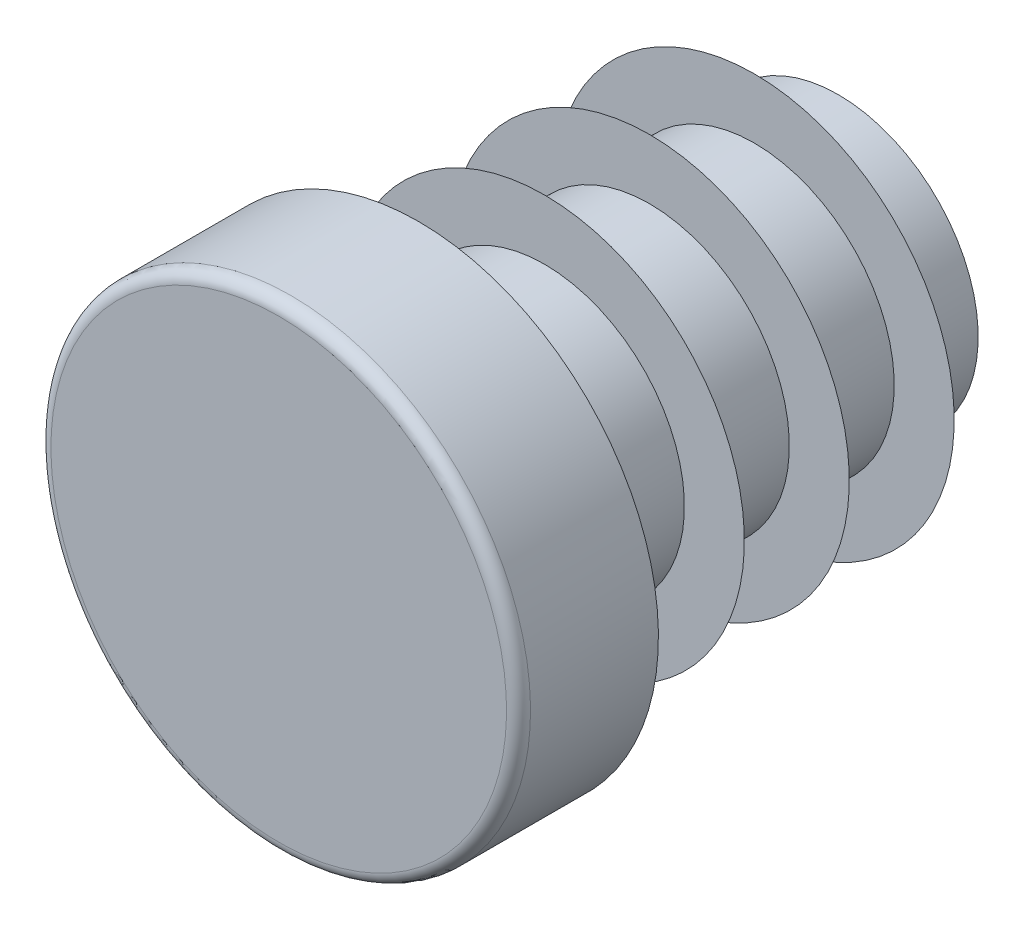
ISO-10303-21;
HEADER;
FILE_DESCRIPTION(('STEP AP214'),'2;1');
FILE_NAME('part.step','',(''),(''),'','','');
FILE_SCHEMA(('AUTOMOTIVE_DESIGN { 1 0 10303 214 1 1 1 1 }'));
ENDSEC;
DATA;
#1=APPLICATION_CONTEXT('core data for automotive mechanical design processes');
#2=APPLICATION_PROTOCOL_DEFINITION('international standard','automotive_design',2000,#1);
#3=PRODUCT_CONTEXT('',#1,'mechanical');
#4=PRODUCT('Part','Part','',(#3));
#5=PRODUCT_RELATED_PRODUCT_CATEGORY('part','',(#4));
#6=PRODUCT_DEFINITION_FORMATION('','',#4);
#7=PRODUCT_DEFINITION_CONTEXT('part definition',#1,'design');
#8=PRODUCT_DEFINITION('design','',#6,#7);
#9=PRODUCT_DEFINITION_SHAPE('','',#8);
#10=(LENGTH_UNIT() NAMED_UNIT(*) SI_UNIT(.MILLI.,.METRE.));
#11=(NAMED_UNIT(*) PLANE_ANGLE_UNIT() SI_UNIT($,.RADIAN.));
#12=(NAMED_UNIT(*) SI_UNIT($,.STERADIAN.) SOLID_ANGLE_UNIT());
#13=UNCERTAINTY_MEASURE_WITH_UNIT(LENGTH_MEASURE(1.E-05),#10,'distance_accuracy_value','');
#14=(GEOMETRIC_REPRESENTATION_CONTEXT(3) GLOBAL_UNCERTAINTY_ASSIGNED_CONTEXT((#13)) GLOBAL_UNIT_ASSIGNED_CONTEXT((#10,
#11,#12)) REPRESENTATION_CONTEXT('',''));
#15=CARTESIAN_POINT('',(0.,0.,0.));
#16=DIRECTION('',(0.,0.,1.));
#17=DIRECTION('',(1.,0.,0.));
#18=AXIS2_PLACEMENT_3D('',#15,#16,#17);
#19=CARTESIAN_POINT('',(0.,0.,3.5));
#20=DIRECTION('',(0.,0.,-1.));
#21=DIRECTION('',(0.,1.,0.));
#22=AXIS2_PLACEMENT_3D('',#19,#20,#21);
#23=PLANE('',#22);
#24=CARTESIAN_POINT('',(0.,0.,3.5));
#25=DIRECTION('',(0.,0.,-1.));
#26=DIRECTION('',(0.,1.,0.));
#27=AXIS2_PLACEMENT_3D('',#24,#25,#26);
#28=CIRCLE('',#27,5.7);
#29=CARTESIAN_POINT('',(0.,5.7,3.5));
#30=VERTEX_POINT('',#29);
#31=EDGE_CURVE('E8',#30,#30,#28,.T.);
#32=ORIENTED_EDGE('',*,*,#31,.F.);
#33=EDGE_LOOP('',(#32));
#34=FACE_BOUND('',#33,.T.);
#35=ADVANCED_FACE('F12',(#34),#23,.F.);
#36=CARTESIAN_POINT('',(0.,0.,3.2));
#37=DIRECTION('',(0.,0.,-1.));
#38=DIRECTION('',(0.,1.,0.));
#39=AXIS2_PLACEMENT_3D('',#36,#37,#38);
#40=TOROIDAL_SURFACE('',#39,5.7,0.3);
#41=ORIENTED_EDGE('',*,*,#31,.T.);
#42=EDGE_LOOP('',(#41));
#43=FACE_BOUND('',#42,.T.);
#44=CARTESIAN_POINT('',(0.,0.,3.20000000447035));
#45=DIRECTION('',(0.,0.,-1.));
#46=DIRECTION('',(0.,1.,0.));
#47=AXIS2_PLACEMENT_3D('',#44,#45,#46);
#48=CIRCLE('',#47,6.);
#49=CARTESIAN_POINT('',(0.,6.,3.20000000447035));
#50=VERTEX_POINT('',#49);
#51=EDGE_CURVE('E18',#50,#50,#48,.T.);
#52=ORIENTED_EDGE('',*,*,#51,.F.);
#53=EDGE_LOOP('',(#52));
#54=FACE_BOUND('',#53,.T.);
#55=ADVANCED_FACE('F159',(#43,#54),#40,.T.);
#56=CARTESIAN_POINT('',(0.,0.,-10.5));
#57=DIRECTION('',(0.,0.,-1.));
#58=DIRECTION('',(0.,1.,0.));
#59=AXIS2_PLACEMENT_3D('',#56,#57,#58);
#60=CYLINDRICAL_SURFACE('',#59,6.);
#61=CARTESIAN_POINT('',(0.,0.,0.));
#62=DIRECTION('',(0.,0.,-1.));
#63=DIRECTION('',(0.,1.,0.));
#64=AXIS2_PLACEMENT_3D('',#61,#62,#63);
#65=CIRCLE('',#64,6.);
#66=CARTESIAN_POINT('',(0.,6.,0.));
#67=VERTEX_POINT('',#66);
#68=EDGE_CURVE('E22',#67,#67,#65,.T.);
#69=ORIENTED_EDGE('',*,*,#68,.F.);
#70=EDGE_LOOP('',(#69));
#71=FACE_BOUND('',#70,.T.);
#72=ORIENTED_EDGE('',*,*,#51,.T.);
#73=EDGE_LOOP('',(#72));
#74=FACE_BOUND('',#73,.T.);
#75=ADVANCED_FACE('F154',(#71,#74),#60,.T.);
#76=CARTESIAN_POINT('',(6.,0.,0.));
#77=DIRECTION('',(0.,0.,1.));
#78=DIRECTION('',(0.,-1.,0.));
#79=AXIS2_PLACEMENT_3D('',#76,#77,#78);
#80=PLANE('',#79);
#81=CARTESIAN_POINT('',(0.,0.,0.));
#82=DIRECTION('',(0.,0.,-1.));
#83=DIRECTION('',(0.,1.,0.));
#84=AXIS2_PLACEMENT_3D('',#81,#82,#83);
#85=CIRCLE('',#84,3.5);
#86=CARTESIAN_POINT('',(0.,3.5,0.));
#87=VERTEX_POINT('',#86);
#88=EDGE_CURVE('E26',#87,#87,#85,.T.);
#89=ORIENTED_EDGE('',*,*,#88,.F.);
#90=EDGE_LOOP('',(#89));
#91=FACE_BOUND('',#90,.T.);
#92=ORIENTED_EDGE('',*,*,#68,.T.);
#93=EDGE_LOOP('',(#92));
#94=FACE_BOUND('',#93,.T.);
#95=ADVANCED_FACE('F148',(#91,#94),#80,.F.);
#96=CARTESIAN_POINT('',(0.,0.,-10.5));
#97=DIRECTION('',(0.,0.,-1.));
#98=DIRECTION('',(0.,1.,0.));
#99=AXIS2_PLACEMENT_3D('',#96,#97,#98);
#100=CYLINDRICAL_SURFACE('',#99,3.5);
#101=CARTESIAN_POINT('',(0.,0.,-0.525));
#102=DIRECTION('',(0.,0.,-1.));
#103=DIRECTION('',(0.,1.,0.));
#104=AXIS2_PLACEMENT_3D('',#101,#102,#103);
#105=CIRCLE('',#104,3.5);
#106=CARTESIAN_POINT('',(0.,3.5,-0.525));
#107=VERTEX_POINT('',#106);
#108=EDGE_CURVE('E31',#107,#107,#105,.T.);
#109=ORIENTED_EDGE('',*,*,#108,.F.);
#110=EDGE_LOOP('',(#109));
#111=FACE_BOUND('',#110,.T.);
#112=ORIENTED_EDGE('',*,*,#88,.T.);
#113=EDGE_LOOP('',(#112));
#114=FACE_BOUND('',#113,.T.);
#115=ADVANCED_FACE('F142',(#111,#114),#100,.T.);
#116=CARTESIAN_POINT('',(3.5,0.,-0.525));
#117=DIRECTION('',(0.,0.,-1.));
#118=DIRECTION('',(0.,1.,0.));
#119=AXIS2_PLACEMENT_3D('',#116,#117,#118);
#120=PLANE('',#119);
#121=CARTESIAN_POINT('',(0.,0.,-0.525));
#122=DIRECTION('',(0.,0.,-1.));
#123=DIRECTION('',(0.,1.,0.));
#124=AXIS2_PLACEMENT_3D('',#121,#122,#123);
#125=CIRCLE('',#124,5.);
#126=CARTESIAN_POINT('',(0.,5.,-0.525));
#127=VERTEX_POINT('',#126);
#128=EDGE_CURVE('E34',#127,#127,#125,.T.);
#129=ORIENTED_EDGE('',*,*,#128,.F.);
#130=EDGE_LOOP('',(#129));
#131=FACE_BOUND('',#130,.T.);
#132=ORIENTED_EDGE('',*,*,#108,.T.);
#133=EDGE_LOOP('',(#132));
#134=FACE_BOUND('',#133,.T.);
#135=ADVANCED_FACE('F136',(#131,#134),#120,.F.);
#136=CARTESIAN_POINT('',(0.,0.,-0.525));
#137=DIRECTION('',(0.,0.,1.));
#138=DIRECTION('',(0.,-1.,0.));
#139=AXIS2_PLACEMENT_3D('',#136,#137,#138);
#140=CONICAL_SURFACE('',#139,5.,0.959931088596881);
#141=CARTESIAN_POINT('',(0.,0.,-1.57531130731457));
#142=DIRECTION('',(0.,0.,-1.));
#143=DIRECTION('',(0.,1.,0.));
#144=AXIS2_PLACEMENT_3D('',#141,#142,#143);
#145=CIRCLE('',#144,3.5);
#146=CARTESIAN_POINT('',(0.,3.5,-1.57531130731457));
#147=VERTEX_POINT('',#146);
#148=EDGE_CURVE('E37',#147,#147,#145,.T.);
#149=ORIENTED_EDGE('',*,*,#148,.F.);
#150=EDGE_LOOP('',(#149));
#151=FACE_BOUND('',#150,.T.);
#152=ORIENTED_EDGE('',*,*,#128,.T.);
#153=EDGE_LOOP('',(#152));
#154=FACE_BOUND('',#153,.T.);
#155=ADVANCED_FACE('F130',(#151,#154),#140,.T.);
#156=CARTESIAN_POINT('',(0.,0.,-10.5));
#157=DIRECTION('',(0.,0.,-1.));
#158=DIRECTION('',(0.,1.,0.));
#159=AXIS2_PLACEMENT_3D('',#156,#157,#158);
#160=CYLINDRICAL_SURFACE('',#159,3.5);
#161=CARTESIAN_POINT('',(0.,0.,-3.15));
#162=DIRECTION('',(0.,0.,-1.));
#163=DIRECTION('',(0.,1.,0.));
#164=AXIS2_PLACEMENT_3D('',#161,#162,#163);
#165=CIRCLE('',#164,3.5);
#166=CARTESIAN_POINT('',(0.,3.5,-3.15));
#167=VERTEX_POINT('',#166);
#168=EDGE_CURVE('E40',#167,#167,#165,.T.);
#169=ORIENTED_EDGE('',*,*,#168,.F.);
#170=EDGE_LOOP('',(#169));
#171=FACE_BOUND('',#170,.T.);
#172=ORIENTED_EDGE('',*,*,#148,.T.);
#173=EDGE_LOOP('',(#172));
#174=FACE_BOUND('',#173,.T.);
#175=ADVANCED_FACE('F124',(#171,#174),#160,.T.);
#176=CARTESIAN_POINT('',(3.5,0.,-3.15));
#177=DIRECTION('',(0.,0.,-1.));
#178=DIRECTION('',(0.,1.,0.));
#179=AXIS2_PLACEMENT_3D('',#176,#177,#178);
#180=PLANE('',#179);
#181=CARTESIAN_POINT('',(0.,0.,-3.15));
#182=DIRECTION('',(0.,0.,-1.));
#183=DIRECTION('',(0.,1.,0.));
#184=AXIS2_PLACEMENT_3D('',#181,#182,#183);
#185=CIRCLE('',#184,5.);
#186=CARTESIAN_POINT('',(0.,5.,-3.15));
#187=VERTEX_POINT('',#186);
#188=EDGE_CURVE('E43',#187,#187,#185,.T.);
#189=ORIENTED_EDGE('',*,*,#188,.F.);
#190=EDGE_LOOP('',(#189));
#191=FACE_BOUND('',#190,.T.);
#192=ORIENTED_EDGE('',*,*,#168,.T.);
#193=EDGE_LOOP('',(#192));
#194=FACE_BOUND('',#193,.T.);
#195=ADVANCED_FACE('F118',(#191,#194),#180,.F.);
#196=CARTESIAN_POINT('',(0.,0.,-3.15));
#197=DIRECTION('',(0.,0.,1.));
#198=DIRECTION('',(0.,-1.,0.));
#199=AXIS2_PLACEMENT_3D('',#196,#197,#198);
#200=CONICAL_SURFACE('',#199,5.,0.959931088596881);
#201=CARTESIAN_POINT('',(0.,0.,-4.20031130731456));
#202=DIRECTION('',(0.,0.,-1.));
#203=DIRECTION('',(0.,1.,0.));
#204=AXIS2_PLACEMENT_3D('',#201,#202,#203);
#205=CIRCLE('',#204,3.5);
#206=CARTESIAN_POINT('',(0.,3.5,-4.20031130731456));
#207=VERTEX_POINT('',#206);
#208=EDGE_CURVE('E46',#207,#207,#205,.T.);
#209=ORIENTED_EDGE('',*,*,#208,.F.);
#210=EDGE_LOOP('',(#209));
#211=FACE_BOUND('',#210,.T.);
#212=ORIENTED_EDGE('',*,*,#188,.T.);
#213=EDGE_LOOP('',(#212));
#214=FACE_BOUND('',#213,.T.);
#215=ADVANCED_FACE('F112',(#211,#214),#200,.T.);
#216=CARTESIAN_POINT('',(0.,0.,-10.5));
#217=DIRECTION('',(0.,0.,-1.));
#218=DIRECTION('',(0.,1.,0.));
#219=AXIS2_PLACEMENT_3D('',#216,#217,#218);
#220=CYLINDRICAL_SURFACE('',#219,3.5);
#221=CARTESIAN_POINT('',(0.,0.,-5.775));
#222=DIRECTION('',(0.,0.,-1.));
#223=DIRECTION('',(0.,1.,0.));
#224=AXIS2_PLACEMENT_3D('',#221,#222,#223);
#225=CIRCLE('',#224,3.5);
#226=CARTESIAN_POINT('',(0.,3.5,-5.775));
#227=VERTEX_POINT('',#226);
#228=EDGE_CURVE('E49',#227,#227,#225,.T.);
#229=ORIENTED_EDGE('',*,*,#228,.F.);
#230=EDGE_LOOP('',(#229));
#231=FACE_BOUND('',#230,.T.);
#232=ORIENTED_EDGE('',*,*,#208,.T.);
#233=EDGE_LOOP('',(#232));
#234=FACE_BOUND('',#233,.T.);
#235=ADVANCED_FACE('F106',(#231,#234),#220,.T.);
#236=CARTESIAN_POINT('',(3.5,0.,-5.775));
#237=DIRECTION('',(0.,0.,-1.));
#238=DIRECTION('',(0.,1.,0.));
#239=AXIS2_PLACEMENT_3D('',#236,#237,#238);
#240=PLANE('',#239);
#241=CARTESIAN_POINT('',(0.,0.,-5.775));
#242=DIRECTION('',(0.,0.,-1.));
#243=DIRECTION('',(0.,1.,0.));
#244=AXIS2_PLACEMENT_3D('',#241,#242,#243);
#245=CIRCLE('',#244,5.);
#246=CARTESIAN_POINT('',(0.,5.,-5.775));
#247=VERTEX_POINT('',#246);
#248=EDGE_CURVE('E52',#247,#247,#245,.T.);
#249=ORIENTED_EDGE('',*,*,#248,.F.);
#250=EDGE_LOOP('',(#249));
#251=FACE_BOUND('',#250,.T.);
#252=ORIENTED_EDGE('',*,*,#228,.T.);
#253=EDGE_LOOP('',(#252));
#254=FACE_BOUND('',#253,.T.);
#255=ADVANCED_FACE('F100',(#251,#254),#240,.F.);
#256=CARTESIAN_POINT('',(0.,0.,-5.775));
#257=DIRECTION('',(0.,0.,1.));
#258=DIRECTION('',(0.,-1.,0.));
#259=AXIS2_PLACEMENT_3D('',#256,#257,#258);
#260=CONICAL_SURFACE('',#259,5.,0.959931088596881);
#261=CARTESIAN_POINT('',(0.,0.,-6.82531130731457));
#262=DIRECTION('',(0.,0.,-1.));
#263=DIRECTION('',(0.,1.,0.));
#264=AXIS2_PLACEMENT_3D('',#261,#262,#263);
#265=CIRCLE('',#264,3.5);
#266=CARTESIAN_POINT('',(0.,3.5,-6.82531130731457));
#267=VERTEX_POINT('',#266);
#268=EDGE_CURVE('E55',#267,#267,#265,.T.);
#269=ORIENTED_EDGE('',*,*,#268,.F.);
#270=EDGE_LOOP('',(#269));
#271=FACE_BOUND('',#270,.T.);
#272=ORIENTED_EDGE('',*,*,#248,.T.);
#273=EDGE_LOOP('',(#272));
#274=FACE_BOUND('',#273,.T.);
#275=ADVANCED_FACE('F94',(#271,#274),#260,.T.);
#276=CARTESIAN_POINT('',(0.,0.,-10.5));
#277=DIRECTION('',(0.,0.,-1.));
#278=DIRECTION('',(0.,1.,0.));
#279=AXIS2_PLACEMENT_3D('',#276,#277,#278);
#280=CYLINDRICAL_SURFACE('',#279,3.5);
#281=CARTESIAN_POINT('',(0.,0.,-8.4));
#282=DIRECTION('',(0.,0.,-1.));
#283=DIRECTION('',(0.,1.,0.));
#284=AXIS2_PLACEMENT_3D('',#281,#282,#283);
#285=CIRCLE('',#284,3.5);
#286=CARTESIAN_POINT('',(0.,3.5,-8.4));
#287=VERTEX_POINT('',#286);
#288=EDGE_CURVE('E58',#287,#287,#285,.T.);
#289=ORIENTED_EDGE('',*,*,#288,.F.);
#290=EDGE_LOOP('',(#289));
#291=FACE_BOUND('',#290,.T.);
#292=ORIENTED_EDGE('',*,*,#268,.T.);
#293=EDGE_LOOP('',(#292));
#294=FACE_BOUND('',#293,.T.);
#295=ADVANCED_FACE('F88',(#291,#294),#280,.T.);
#296=CARTESIAN_POINT('',(3.5,0.,-8.4));
#297=DIRECTION('',(0.,0.,-1.));
#298=DIRECTION('',(0.,1.,0.));
#299=AXIS2_PLACEMENT_3D('',#296,#297,#298);
#300=PLANE('',#299);
#301=CARTESIAN_POINT('',(0.,0.,-8.4));
#302=DIRECTION('',(0.,0.,-1.));
#303=DIRECTION('',(0.,1.,0.));
#304=AXIS2_PLACEMENT_3D('',#301,#302,#303);
#305=CIRCLE('',#304,5.);
#306=CARTESIAN_POINT('',(0.,5.,-8.4));
#307=VERTEX_POINT('',#306);
#308=EDGE_CURVE('E61',#307,#307,#305,.T.);
#309=ORIENTED_EDGE('',*,*,#308,.F.);
#310=EDGE_LOOP('',(#309));
#311=FACE_BOUND('',#310,.T.);
#312=ORIENTED_EDGE('',*,*,#288,.T.);
#313=EDGE_LOOP('',(#312));
#314=FACE_BOUND('',#313,.T.);
#315=ADVANCED_FACE('F82',(#311,#314),#300,.F.);
#316=CARTESIAN_POINT('',(0.,0.,-8.4));
#317=DIRECTION('',(0.,0.,1.));
#318=DIRECTION('',(0.,-1.,0.));
#319=AXIS2_PLACEMENT_3D('',#316,#317,#318);
#320=CONICAL_SURFACE('',#319,5.,0.959931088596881);
#321=CARTESIAN_POINT('',(0.,0.,-9.45031130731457));
#322=DIRECTION('',(0.,0.,-1.));
#323=DIRECTION('',(0.,1.,0.));
#324=AXIS2_PLACEMENT_3D('',#321,#322,#323);
#325=CIRCLE('',#324,3.5);
#326=CARTESIAN_POINT('',(0.,3.5,-9.45031130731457));
#327=VERTEX_POINT('',#326);
#328=EDGE_CURVE('E64',#327,#327,#325,.T.);
#329=ORIENTED_EDGE('',*,*,#328,.F.);
#330=EDGE_LOOP('',(#329));
#331=FACE_BOUND('',#330,.T.);
#332=ORIENTED_EDGE('',*,*,#308,.T.);
#333=EDGE_LOOP('',(#332));
#334=FACE_BOUND('',#333,.T.);
#335=ADVANCED_FACE('F76',(#331,#334),#320,.T.);
#336=CARTESIAN_POINT('',(0.,0.,-10.5));
#337=DIRECTION('',(0.,0.,-1.));
#338=DIRECTION('',(0.,1.,0.));
#339=AXIS2_PLACEMENT_3D('',#336,#337,#338);
#340=CYLINDRICAL_SURFACE('',#339,3.5);
#341=CARTESIAN_POINT('',(0.,0.,-10.5));
#342=DIRECTION('',(0.,0.,-1.));
#343=DIRECTION('',(0.,1.,0.));
#344=AXIS2_PLACEMENT_3D('',#341,#342,#343);
#345=CIRCLE('',#344,3.5);
#346=CARTESIAN_POINT('',(0.,3.5,-10.5));
#347=VERTEX_POINT('',#346);
#348=EDGE_CURVE('E67',#347,#347,#345,.T.);
#349=ORIENTED_EDGE('',*,*,#348,.F.);
#350=EDGE_LOOP('',(#349));
#351=FACE_BOUND('',#350,.T.);
#352=ORIENTED_EDGE('',*,*,#328,.T.);
#353=EDGE_LOOP('',(#352));
#354=FACE_BOUND('',#353,.T.);
#355=ADVANCED_FACE('F73',(#351,#354),#340,.T.);
#356=CARTESIAN_POINT('',(3.5,0.,-10.5));
#357=DIRECTION('',(0.,0.,1.));
#358=DIRECTION('',(0.,-1.,0.));
#359=AXIS2_PLACEMENT_3D('',#356,#357,#358);
#360=PLANE('',#359);
#361=ORIENTED_EDGE('',*,*,#348,.T.);
#362=EDGE_LOOP('',(#361));
#363=FACE_BOUND('',#362,.T.);
#364=ADVANCED_FACE('F71',(#363),#360,.F.);
#365=CLOSED_SHELL('',(#35,#55,#75,#95,#115,#135,#155,#175,#195,#215,#235,#255,#275,#295,#315,
#335,#355,#364));
#366=MANIFOLD_SOLID_BREP('B1',#365);
#367=ADVANCED_BREP_SHAPE_REPRESENTATION('',(#18,#366),#14);
#368=SHAPE_DEFINITION_REPRESENTATION(#9,#367);
ENDSEC;
END-ISO-10303-21;
